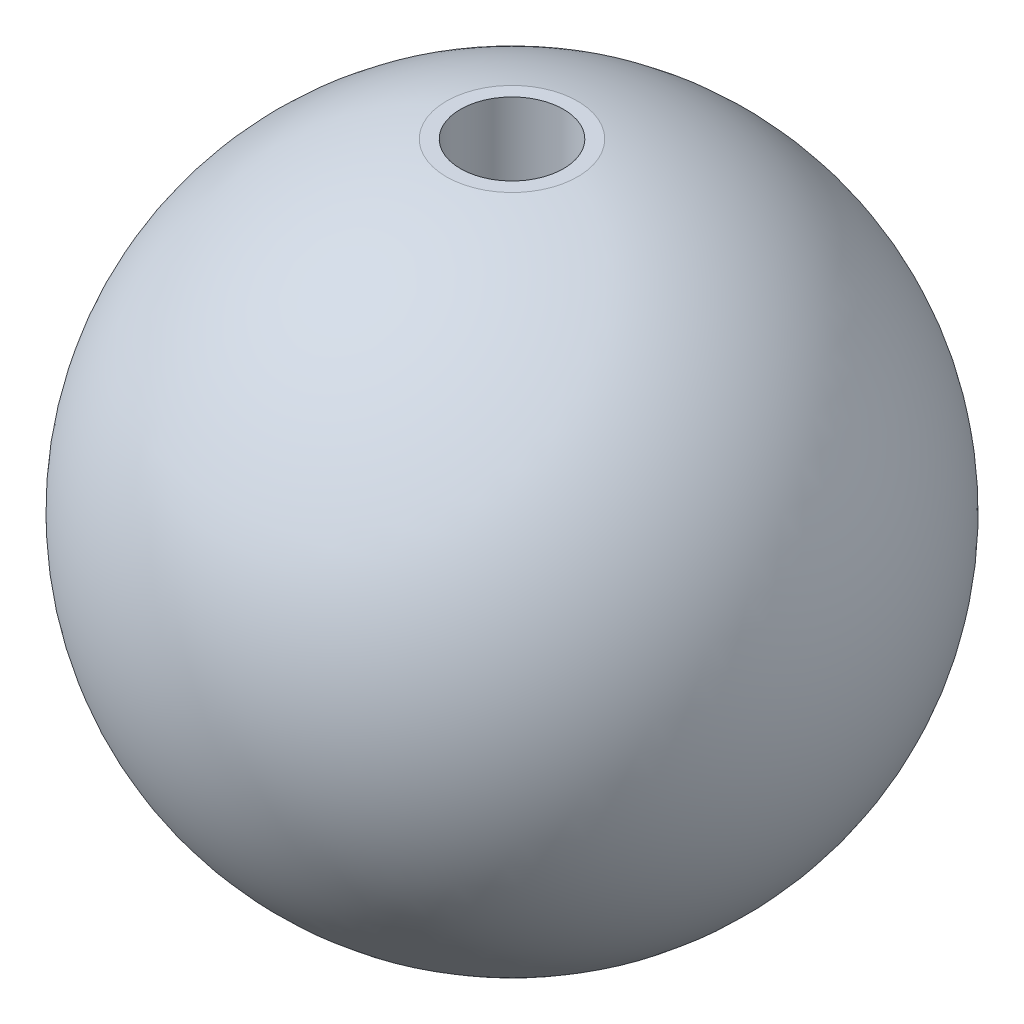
from build123d import *

# Parameters (mm, degrees)
SKETCH7_R                   = 6.35
CUT_EXTRUDE1_DEPTH          = 0.508
F_3_8_16_TAPPED_HOLE1_D     = 7.9375
F_3_8_16_TAPPED_HOLE1_DEPTH = 26.924
F_3_8_16_TAPPED_HOLE1_TIP   = 2.384665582


with BuildPart() as part:
    # Sketch3 → Revolve1 (revolve)
    with BuildSketch(Plane.XY):
        with BuildLine():
            Line((0, -25.4), (0, 25.4))
            ThreePointArc((0, 25.4), (25.4, 0), (0, -25.4))
        make_face()
    revolve(axis=Axis((0, -25.4, 0), (0, 1, 0)))

    # Sketch7 → Cut-Extrude1 (cut)
    with BuildSketch(Plane(origin=(0, 25.4, 0), x_dir=(-1, 0, 0), z_dir=(0, 1, 0))):
        Circle(SKETCH7_R)
    extrude(amount=-CUT_EXTRUDE1_DEPTH, mode=Mode.SUBTRACT)

    # 3_8-16 Tapped Hole1
    with Locations(Plane.ZX.offset(24.892)):
        with Locations((0, 0)):
            Hole(F_3_8_16_TAPPED_HOLE1_D / 2, depth=F_3_8_16_TAPPED_HOLE1_DEPTH)
            with Locations((0, 0, -(F_3_8_16_TAPPED_HOLE1_DEPTH + F_3_8_16_TAPPED_HOLE1_TIP / 2))):  # 118° drill point
                Cone(0, F_3_8_16_TAPPED_HOLE1_D / 2, F_3_8_16_TAPPED_HOLE1_TIP, mode=Mode.SUBTRACT)


solid = part.part
